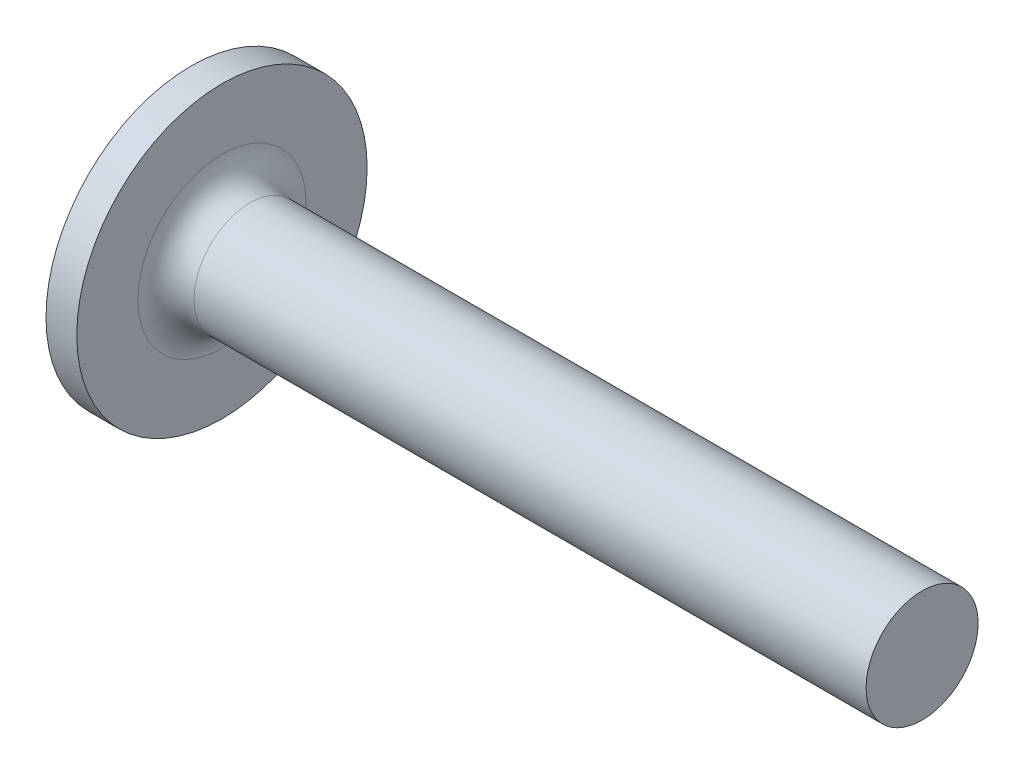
ISO-10303-21;
HEADER;
FILE_DESCRIPTION(('STEP AP214'),'2;1');
FILE_NAME('part.step','',(''),(''),'','','');
FILE_SCHEMA(('AUTOMOTIVE_DESIGN { 1 0 10303 214 1 1 1 1 }'));
ENDSEC;
DATA;
#1=APPLICATION_CONTEXT('core data for automotive mechanical design processes');
#2=APPLICATION_PROTOCOL_DEFINITION('international standard','automotive_design',2000,#1);
#3=PRODUCT_CONTEXT('',#1,'mechanical');
#4=PRODUCT('Part','Part','',(#3));
#5=PRODUCT_RELATED_PRODUCT_CATEGORY('part','',(#4));
#6=PRODUCT_DEFINITION_FORMATION('','',#4);
#7=PRODUCT_DEFINITION_CONTEXT('part definition',#1,'design');
#8=PRODUCT_DEFINITION('design','',#6,#7);
#9=PRODUCT_DEFINITION_SHAPE('','',#8);
#10=(LENGTH_UNIT() NAMED_UNIT(*) SI_UNIT(.MILLI.,.METRE.));
#11=(NAMED_UNIT(*) PLANE_ANGLE_UNIT() SI_UNIT($,.RADIAN.));
#12=(NAMED_UNIT(*) SI_UNIT($,.STERADIAN.) SOLID_ANGLE_UNIT());
#13=UNCERTAINTY_MEASURE_WITH_UNIT(LENGTH_MEASURE(1.E-05),#10,'distance_accuracy_value','');
#14=(GEOMETRIC_REPRESENTATION_CONTEXT(3) GLOBAL_UNCERTAINTY_ASSIGNED_CONTEXT((#13)) GLOBAL_UNIT_ASSIGNED_CONTEXT((#10,
#11,#12)) REPRESENTATION_CONTEXT('',''));
#15=CARTESIAN_POINT('',(0.,0.,0.));
#16=DIRECTION('',(0.,0.,1.));
#17=DIRECTION('',(1.,0.,0.));
#18=AXIS2_PLACEMENT_3D('',#15,#16,#17);
#19=CARTESIAN_POINT('',(4.6,-2.10652468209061,1.08));
#20=DIRECTION('',(0.,0.,1.));
#21=DIRECTION('',(1.,0.,0.));
#22=AXIS2_PLACEMENT_3D('',#19,#20,#21);
#23=PLANE('',#22);
#24=CARTESIAN_POINT('',(-3.41826491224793,-2.24491338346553,1.08));
#25=CARTESIAN_POINT('',(-2.73358329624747,-2.19177170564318,1.08));
#26=CARTESIAN_POINT('',(-2.04892704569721,-2.13829978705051,1.08));
#27=CARTESIAN_POINT('',(-0.679674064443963,-2.03046942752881,1.08));
#28=CARTESIAN_POINT('',(0.00492266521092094,-1.97611097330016,1.08));
#29=CARTESIAN_POINT('',(1.37402690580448,-1.86628311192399,1.08));
#30=CARTESIAN_POINT('',(2.05853441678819,-1.81081370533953,1.08));
#31=CARTESIAN_POINT('',(3.08520090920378,-1.72651192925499,1.08));
#32=CARTESIAN_POINT('',(3.4274049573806,-1.69822858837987,1.08));
#33=CARTESIAN_POINT('',(4.11177903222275,-1.64123354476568,1.08));
#34=CARTESIAN_POINT('',(4.45394905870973,-1.6125218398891,1.08));
#35=CARTESIAN_POINT('',(5.52850433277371,-1.52157600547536,1.08));
#36=CARTESIAN_POINT('',(6.26081563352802,-1.45845930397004,1.08));
#37=CARTESIAN_POINT('',(7.35905590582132,-1.36129752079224,1.08));
#38=CARTESIAN_POINT('',(7.7250949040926,-1.32849611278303,1.08));
#39=CARTESIAN_POINT('',(8.45707977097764,-1.26185170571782,1.08));
#40=CARTESIAN_POINT('',(8.82302563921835,-1.22800870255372,1.08));
#41=CARTESIAN_POINT('',(9.55482746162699,-1.15899574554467,1.08));
#42=CARTESIAN_POINT('',(9.92068340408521,-1.12382566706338,1.08));
#43=CARTESIAN_POINT('',(10.6522200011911,-1.05174208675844,1.08));
#44=CARTESIAN_POINT('',(11.0179006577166,-1.01482860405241,1.08));
#45=CARTESIAN_POINT('',(11.7490413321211,-0.938612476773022,1.08));
#46=CARTESIAN_POINT('',(12.1145013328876,-0.899309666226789,1.08));
#47=CARTESIAN_POINT('',(12.662403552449,-0.837726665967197,1.08));
#48=CARTESIAN_POINT('',(12.8449930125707,-0.816760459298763,1.08));
#49=CARTESIAN_POINT('',(13.2100411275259,-0.773701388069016,1.08));
#50=CARTESIAN_POINT('',(13.3924997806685,-0.751608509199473,1.08));
#51=CARTESIAN_POINT('',(13.5748743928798,-0.72882726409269,1.08));
#52=B_SPLINE_CURVE_WITH_KNOTS('',3,(#24,#25,#26,#27,#28,#29,#30,#31,#32,#33,#34,#35,#36,#37,#38,
#39,#40,#41,#42,#43,#44,#45,#46,#47,#48,#49,#50,#51),.UNSPECIFIED.,.F.,.F.,(4,2,2,2,2,2,2,2,2,2,
2,2,2,4),(0.,2.06022276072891,4.12047645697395,6.18072910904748,7.21084146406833,
8.24095896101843,10.4460312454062,11.5485474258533,12.6510679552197,13.753692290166,
14.8563045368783,15.9589934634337,16.5103581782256,17.0617298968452),.UNSPECIFIED.);
#53=CARTESIAN_POINT('',(4.6,-1.60013444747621,1.08));
#54=VERTEX_POINT('',#53);
#55=CARTESIAN_POINT('',(0.229677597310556,-1.95799778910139,1.08));
#56=VERTEX_POINT('',#55);
#57=EDGE_CURVE('E329',#54,#56,#52,.F.);
#58=ORIENTED_EDGE('',*,*,#57,.F.);
#59=DIRECTION('',(0.,1.,0.));
#60=VECTOR('',#59,1.);
#61=CARTESIAN_POINT('',(4.6,-2.10652468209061,1.08));
#62=LINE('',#61,#60);
#63=CARTESIAN_POINT('',(4.6,-2.10652468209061,1.08));
#64=VERTEX_POINT('',#63);
#65=EDGE_CURVE('E288',#64,#54,#62,.T.);
#66=ORIENTED_EDGE('',*,*,#65,.F.);
#67=DIRECTION('',(0.894934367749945,0.446197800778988,0.));
#68=VECTOR('',#67,1.);
#69=CARTESIAN_POINT('',(0.,-4.4,1.08));
#70=LINE('',#69,#68);
#71=CARTESIAN_POINT('',(0.808838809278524,-3.9967278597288,1.08));
#72=VERTEX_POINT('',#71);
#73=EDGE_CURVE('E274',#72,#64,#70,.T.);
#74=ORIENTED_EDGE('',*,*,#73,.F.);
#75=CARTESIAN_POINT('',(11.,0.,1.08));
#76=DIRECTION('',(0.,0.,1.));
#77=DIRECTION('',(1.,0.,0.));
#78=AXIS2_PLACEMENT_3D('',#75,#76,#77);
#79=CIRCLE('',#78,10.9468534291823);
#80=EDGE_CURVE('E212',#56,#72,#79,.T.);
#81=ORIENTED_EDGE('',*,*,#80,.F.);
#82=EDGE_LOOP('',(#58,#66,#74,#81));
#83=FACE_BOUND('',#82,.T.);
#84=ADVANCED_FACE('F39',(#83),#23,.F.);
#85=CARTESIAN_POINT('',(4.6,2.106524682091,-1.08));
#86=DIRECTION('',(0.,0.,-1.));
#87=DIRECTION('',(0.,1.,0.));
#88=AXIS2_PLACEMENT_3D('',#85,#86,#87);
#89=PLANE('',#88);
#90=CARTESIAN_POINT('',(-3.4182649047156,-2.24491338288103,-1.08));
#91=CARTESIAN_POINT('',(-2.73358328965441,-2.19177170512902,-1.08));
#92=CARTESIAN_POINT('',(-2.04892704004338,-2.13829978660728,-1.08));
#93=CARTESIAN_POINT('',(-0.679674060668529,-2.03046942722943,-1.08));
#94=CARTESIAN_POINT('',(0.00492266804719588,-1.97611097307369,-1.08));
#95=CARTESIAN_POINT('',(1.37402690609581,-1.86628311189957,-1.08));
#96=CARTESIAN_POINT('',(2.05853441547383,-1.81081370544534,-1.08));
#97=CARTESIAN_POINT('',(3.08520090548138,-1.7265119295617,-1.08));
#98=CARTESIAN_POINT('',(3.42740495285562,-1.69822858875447,-1.08));
#99=CARTESIAN_POINT('',(4.1117790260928,-1.64123354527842,-1.08));
#100=CARTESIAN_POINT('',(4.45394905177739,-1.61252184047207,-1.08));
#101=CARTESIAN_POINT('',(5.52850432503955,-1.52157600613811,-1.08));
#102=CARTESIAN_POINT('',(6.26081562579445,-1.45845930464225,-1.08));
#103=CARTESIAN_POINT('',(7.35905589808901,-1.36129752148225,-1.08));
#104=CARTESIAN_POINT('',(7.7250948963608,-1.32849611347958,-1.08));
#105=CARTESIAN_POINT('',(8.45707976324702,-1.26185170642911,-1.08));
#106=CARTESIAN_POINT('',(8.8230256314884,-1.22800870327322,-1.08));
#107=CARTESIAN_POINT('',(9.55482745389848,-1.15899574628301,-1.08));
#108=CARTESIAN_POINT('',(9.92068339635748,-1.12382566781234,-1.08));
#109=CARTESIAN_POINT('',(10.6522199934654,-1.05174208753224,-1.08));
#110=CARTESIAN_POINT('',(11.017900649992,-1.01482860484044,-1.08));
#111=CARTESIAN_POINT('',(11.7490413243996,-0.938612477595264,-1.08));
#112=CARTESIAN_POINT('',(12.1145013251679,-0.899309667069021,-1.08));
#113=CARTESIAN_POINT('',(12.6624035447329,-0.837726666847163,-1.08));
#114=CARTESIAN_POINT('',(12.8449930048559,-0.816760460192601,-1.08));
#115=CARTESIAN_POINT('',(13.2100411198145,-0.773701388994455,-1.08));
#116=CARTESIAN_POINT('',(13.392499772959,-0.751608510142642,-1.08));
#117=CARTESIAN_POINT('',(13.5748743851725,-0.728827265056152,-1.08));
#118=B_SPLINE_CURVE_WITH_KNOTS('',3,(#90,#91,#92,#93,#94,#95,#96,#97,#98,#99,#100,#101,#102,
#103,#104,#105,#106,#107,#108,#109,#110,#111,#112,#113,#114,#115,#116,#117),.UNSPECIFIED.,.F.,
.F.,(4,2,2,2,2,2,2,2,2,2,2,2,2,4),(0.,2.0602227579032,4.12047645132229,6.18072909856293,
7.21084145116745,8.24095894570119,10.4460312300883,11.5485474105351,12.6510679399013,
13.7536922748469,14.8563045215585,15.9589934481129,16.5103581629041,17.061729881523),.UNSPECIFIED.);
#119=CARTESIAN_POINT('',(0.229677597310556,-1.95799778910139,-1.08));
#120=VERTEX_POINT('',#119);
#121=CARTESIAN_POINT('',(4.6,-1.60013444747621,-1.08));
#122=VERTEX_POINT('',#121);
#123=EDGE_CURVE('E321',#120,#122,#118,.T.);
#124=ORIENTED_EDGE('',*,*,#123,.F.);
#125=CARTESIAN_POINT('',(11.,0.,-1.08));
#126=DIRECTION('',(0.,0.,-1.));
#127=DIRECTION('',(0.,1.,0.));
#128=AXIS2_PLACEMENT_3D('',#125,#126,#127);
#129=CIRCLE('',#128,10.9468534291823);
#130=CARTESIAN_POINT('',(0.808838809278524,-3.9967278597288,-1.08));
#131=VERTEX_POINT('',#130);
#132=EDGE_CURVE('E217',#131,#120,#129,.T.);
#133=ORIENTED_EDGE('',*,*,#132,.F.);
#134=DIRECTION('',(0.894934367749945,0.446197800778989,0.));
#135=VECTOR('',#134,1.);
#136=CARTESIAN_POINT('',(0.,-4.4,-1.08));
#137=LINE('',#136,#135);
#138=CARTESIAN_POINT('',(4.6,-2.10652468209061,-1.08));
#139=VERTEX_POINT('',#138);
#140=EDGE_CURVE('E277',#131,#139,#137,.T.);
#141=ORIENTED_EDGE('',*,*,#140,.T.);
#142=DIRECTION('',(0.,-1.,0.));
#143=VECTOR('',#142,1.);
#144=CARTESIAN_POINT('',(4.6,2.106524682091,-1.08));
#145=LINE('',#144,#143);
#146=EDGE_CURVE('E287',#122,#139,#145,.T.);
#147=ORIENTED_EDGE('',*,*,#146,.F.);
#148=EDGE_LOOP('',(#124,#133,#141,#147));
#149=FACE_BOUND('',#148,.T.);
#150=ADVANCED_FACE('F171',(#149),#89,.F.);
#151=CARTESIAN_POINT('',(11.,0.,0.));
#152=DIRECTION('',(-1.,0.,0.));
#153=DIRECTION('',(0.,1.,0.));
#154=AXIS2_PLACEMENT_3D('',#151,#152,#153);
#155=SPHERICAL_SURFACE('',#154,11.);
#156=CARTESIAN_POINT('',(3.7,0.,0.));
#157=DIRECTION('',(1.,0.,0.));
#158=DIRECTION('',(0.,0.,-1.));
#159=AXIS2_PLACEMENT_3D('',#156,#157,#158);
#160=CIRCLE('',#159,8.22860863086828);
#161=CARTESIAN_POINT('',(3.7,0.,-8.22860863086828));
#162=VERTEX_POINT('',#161);
#163=EDGE_CURVE('E310',#162,#162,#160,.F.);
#164=ORIENTED_EDGE('',*,*,#163,.T.);
#165=EDGE_LOOP('',(#164));
#166=FACE_BOUND('',#165,.T.);
#167=CARTESIAN_POINT('',(0.229677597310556,0.,0.));
#168=DIRECTION('',(1.,0.,0.));
#169=DIRECTION('',(0.,0.,-1.));
#170=AXIS2_PLACEMENT_3D('',#167,#168,#169);
#171=CIRCLE('',#170,2.23610271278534);
#172=CARTESIAN_POINT('',(0.229677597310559,-1.07999999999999,-1.9579977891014));
#173=VERTEX_POINT('',#172);
#174=EDGE_CURVE('E315',#173,#120,#171,.F.);
#175=ORIENTED_EDGE('',*,*,#174,.F.);
#176=CARTESIAN_POINT('',(11.,-1.08,0.));
#177=DIRECTION('',(0.,-1.,0.));
#178=DIRECTION('',(0.,0.,-1.));
#179=AXIS2_PLACEMENT_3D('',#176,#177,#178);
#180=CIRCLE('',#179,10.9468534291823);
#181=CARTESIAN_POINT('',(0.808838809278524,-1.07999999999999,-3.99672785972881));
#182=VERTEX_POINT('',#181);
#183=EDGE_CURVE('E228',#173,#182,#180,.T.);
#184=ORIENTED_EDGE('',*,*,#183,.T.);
#185=CARTESIAN_POINT('',(10.5669808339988,0.,0.868502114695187));
#186=DIRECTION('',(0.446197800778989,0.,-0.894934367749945));
#187=DIRECTION('',(-0.894934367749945,0.,-0.446197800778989));
#188=AXIS2_PLACEMENT_3D('',#185,#186,#187);
#189=CIRCLE('',#188,10.957107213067);
#190=CARTESIAN_POINT('',(0.808838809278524,1.08000000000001,-3.9967278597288));
#191=VERTEX_POINT('',#190);
#192=EDGE_CURVE('E53',#182,#191,#189,.T.);
#193=ORIENTED_EDGE('',*,*,#192,.T.);
#194=CARTESIAN_POINT('',(11.,1.08,0.));
#195=DIRECTION('',(0.,1.,0.));
#196=DIRECTION('',(0.,0.,1.));
#197=AXIS2_PLACEMENT_3D('',#194,#195,#196);
#198=CIRCLE('',#197,10.9468534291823);
#199=CARTESIAN_POINT('',(0.229677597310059,1.08000000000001,-1.95799778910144));
#200=VERTEX_POINT('',#199);
#201=EDGE_CURVE('E226',#191,#200,#198,.T.);
#202=ORIENTED_EDGE('',*,*,#201,.T.);
#203=CARTESIAN_POINT('',(0.229677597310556,1.95799778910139,-1.08));
#204=VERTEX_POINT('',#203);
#205=EDGE_CURVE('E378',#204,#200,#171,.F.);
#206=ORIENTED_EDGE('',*,*,#205,.F.);
#207=CARTESIAN_POINT('',(0.808838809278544,3.99672785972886,-1.08));
#208=VERTEX_POINT('',#207);
#209=EDGE_CURVE('E312',#204,#208,#129,.T.);
#210=ORIENTED_EDGE('',*,*,#209,.T.);
#211=CARTESIAN_POINT('',(10.5669808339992,-0.868502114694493,0.));
#212=DIRECTION('',(0.446197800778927,0.894934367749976,0.));
#213=DIRECTION('',(-0.894934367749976,0.446197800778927,0.));
#214=AXIS2_PLACEMENT_3D('',#211,#212,#213);
#215=CIRCLE('',#214,10.9571072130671);
#216=CARTESIAN_POINT('',(0.808838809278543,3.99672785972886,1.08));
#217=VERTEX_POINT('',#216);
#218=EDGE_CURVE('E210',#208,#217,#215,.T.);
#219=ORIENTED_EDGE('',*,*,#218,.T.);
#220=CARTESIAN_POINT('',(0.229677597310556,1.95799778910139,1.08));
#221=VERTEX_POINT('',#220);
#222=EDGE_CURVE('E200',#217,#221,#79,.T.);
#223=ORIENTED_EDGE('',*,*,#222,.T.);
#224=CARTESIAN_POINT('',(0.229677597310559,1.07999999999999,1.9579977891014));
#225=VERTEX_POINT('',#224);
#226=EDGE_CURVE('E204',#225,#221,#171,.F.);
#227=ORIENTED_EDGE('',*,*,#226,.F.);
#228=CARTESIAN_POINT('',(0.808838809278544,1.07999999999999,3.99672785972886));
#229=VERTEX_POINT('',#228);
#230=EDGE_CURVE('E245',#225,#229,#198,.T.);
#231=ORIENTED_EDGE('',*,*,#230,.T.);
#232=CARTESIAN_POINT('',(10.5669808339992,0.,-0.868502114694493));
#233=DIRECTION('',(0.446197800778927,0.,0.894934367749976));
#234=DIRECTION('',(0.894934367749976,0.,-0.446197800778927));
#235=AXIS2_PLACEMENT_3D('',#232,#233,#234);
#236=CIRCLE('',#235,10.9571072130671);
#237=CARTESIAN_POINT('',(0.808838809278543,-1.08000000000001,3.99672785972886));
#238=VERTEX_POINT('',#237);
#239=EDGE_CURVE('E215',#229,#238,#236,.T.);
#240=ORIENTED_EDGE('',*,*,#239,.T.);
#241=CARTESIAN_POINT('',(0.22967759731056,-1.08000000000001,1.9579977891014));
#242=VERTEX_POINT('',#241);
#243=EDGE_CURVE('E273',#238,#242,#180,.T.);
#244=ORIENTED_EDGE('',*,*,#243,.T.);
#245=EDGE_CURVE('E333',#56,#242,#171,.F.);
#246=ORIENTED_EDGE('',*,*,#245,.F.);
#247=ORIENTED_EDGE('',*,*,#80,.T.);
#248=CARTESIAN_POINT('',(10.5669808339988,0.868502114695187,0.));
#249=DIRECTION('',(0.446197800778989,-0.894934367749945,0.));
#250=DIRECTION('',(0.894934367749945,0.446197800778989,0.));
#251=AXIS2_PLACEMENT_3D('',#248,#249,#250);
#252=CIRCLE('',#251,10.957107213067);
#253=EDGE_CURVE('E211',#72,#131,#252,.T.);
#254=ORIENTED_EDGE('',*,*,#253,.T.);
#255=ORIENTED_EDGE('',*,*,#132,.T.);
#256=EDGE_LOOP('',(#175,#184,#193,#202,#206,#210,#219,#223,#227,#231,#240,#244,#246,#247,#254,#255));
#257=FACE_BOUND('',#256,.T.);
#258=ADVANCED_FACE('F179',(#166,#257),#155,.T.);
#259=CARTESIAN_POINT('',(-3.41826491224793,2.24491338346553,1.08));
#260=CARTESIAN_POINT('',(-2.73358329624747,2.19177170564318,1.08));
#261=CARTESIAN_POINT('',(-2.04892704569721,2.13829978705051,1.08));
#262=CARTESIAN_POINT('',(-0.679674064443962,2.03046942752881,1.08));
#263=CARTESIAN_POINT('',(0.00492266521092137,1.97611097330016,1.08));
#264=CARTESIAN_POINT('',(1.37402690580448,1.86628311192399,1.08));
#265=CARTESIAN_POINT('',(2.05853441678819,1.81081370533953,1.08));
#266=CARTESIAN_POINT('',(3.08520090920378,1.72651192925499,1.08));
#267=CARTESIAN_POINT('',(3.4274049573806,1.69822858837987,1.08));
#268=CARTESIAN_POINT('',(4.11177903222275,1.64123354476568,1.08));
#269=CARTESIAN_POINT('',(4.45394905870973,1.6125218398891,1.08));
#270=CARTESIAN_POINT('',(5.52850433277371,1.52157600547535,1.08));
#271=CARTESIAN_POINT('',(6.26081563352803,1.45845930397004,1.08));
#272=CARTESIAN_POINT('',(7.35905590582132,1.36129752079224,1.08));
#273=CARTESIAN_POINT('',(7.72509490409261,1.32849611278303,1.08));
#274=CARTESIAN_POINT('',(8.45707977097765,1.26185170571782,1.08));
#275=CARTESIAN_POINT('',(8.82302563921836,1.22800870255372,1.08));
#276=CARTESIAN_POINT('',(9.554827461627,1.15899574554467,1.08));
#277=CARTESIAN_POINT('',(9.92068340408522,1.12382566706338,1.08));
#278=CARTESIAN_POINT('',(10.6522200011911,1.05174208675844,1.08));
#279=CARTESIAN_POINT('',(11.0179006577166,1.01482860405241,1.08));
#280=CARTESIAN_POINT('',(11.7490413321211,0.938612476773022,1.08));
#281=CARTESIAN_POINT('',(12.1145013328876,0.899309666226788,1.08));
#282=CARTESIAN_POINT('',(12.662403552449,0.837726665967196,1.08));
#283=CARTESIAN_POINT('',(12.8449930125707,0.816760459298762,1.08));
#284=CARTESIAN_POINT('',(13.2100411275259,0.773701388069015,1.08));
#285=CARTESIAN_POINT('',(13.3924997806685,0.751608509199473,1.08));
#286=CARTESIAN_POINT('',(13.5748743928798,0.728827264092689,1.08));
#287=B_SPLINE_CURVE_WITH_KNOTS('',3,(#259,#260,#261,#262,#263,#264,#265,#266,#267,#268,#269,
#270,#271,#272,#273,#274,#275,#276,#277,#278,#279,#280,#281,#282,#283,#284,#285,#286),
.UNSPECIFIED.,.F.,.F.,(4,2,2,2,2,2,2,2,2,2,2,2,2,4),(0.,2.06022276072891,4.12047645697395,
6.18072910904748,7.21084146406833,8.24095896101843,10.4460312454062,11.5485474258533,
12.6510679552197,13.753692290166,14.8563045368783,15.9589934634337,16.5103581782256,
17.0617298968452),.UNSPECIFIED.);
#288=CARTESIAN_POINT('',(4.6,1.60013444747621,1.08));
#289=VERTEX_POINT('',#288);
#290=EDGE_CURVE('E198',#221,#289,#287,.T.);
#291=ORIENTED_EDGE('',*,*,#290,.F.);
#292=ORIENTED_EDGE('',*,*,#222,.F.);
#293=DIRECTION('',(0.894934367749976,-0.446197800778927,0.));
#294=VECTOR('',#293,1.);
#295=CARTESIAN_POINT('',(0.,4.4,1.08));
#296=LINE('',#295,#294);
#297=CARTESIAN_POINT('',(4.6,2.106524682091,1.08));
#298=VERTEX_POINT('',#297);
#299=EDGE_CURVE('E67',#217,#298,#296,.T.);
#300=ORIENTED_EDGE('',*,*,#299,.T.);
#301=EDGE_CURVE('E202',#289,#298,#62,.T.);
#302=ORIENTED_EDGE('',*,*,#301,.F.);
#303=EDGE_LOOP('',(#291,#292,#300,#302));
#304=FACE_BOUND('',#303,.T.);
#305=ADVANCED_FACE('F174',(#304),#23,.F.);
#306=CARTESIAN_POINT('',(-3.4182649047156,2.24491338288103,-1.08));
#307=CARTESIAN_POINT('',(-2.73358328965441,2.19177170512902,-1.08));
#308=CARTESIAN_POINT('',(-2.04892704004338,2.13829978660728,-1.08));
#309=CARTESIAN_POINT('',(-0.679674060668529,2.03046942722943,-1.08));
#310=CARTESIAN_POINT('',(0.00492266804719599,1.97611097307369,-1.08));
#311=CARTESIAN_POINT('',(1.37402690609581,1.86628311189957,-1.08));
#312=CARTESIAN_POINT('',(2.05853441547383,1.81081370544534,-1.08));
#313=CARTESIAN_POINT('',(3.08520090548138,1.7265119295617,-1.08));
#314=CARTESIAN_POINT('',(3.42740495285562,1.69822858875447,-1.08));
#315=CARTESIAN_POINT('',(4.1117790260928,1.64123354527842,-1.08));
#316=CARTESIAN_POINT('',(4.45394905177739,1.61252184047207,-1.08));
#317=CARTESIAN_POINT('',(5.52850432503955,1.52157600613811,-1.08));
#318=CARTESIAN_POINT('',(6.26081562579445,1.45845930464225,-1.08));
#319=CARTESIAN_POINT('',(7.35905589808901,1.36129752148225,-1.08));
#320=CARTESIAN_POINT('',(7.7250948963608,1.32849611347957,-1.08));
#321=CARTESIAN_POINT('',(8.45707976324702,1.26185170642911,-1.08));
#322=CARTESIAN_POINT('',(8.8230256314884,1.22800870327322,-1.08));
#323=CARTESIAN_POINT('',(9.55482745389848,1.15899574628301,-1.08));
#324=CARTESIAN_POINT('',(9.92068339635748,1.12382566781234,-1.08));
#325=CARTESIAN_POINT('',(10.6522199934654,1.05174208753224,-1.08));
#326=CARTESIAN_POINT('',(11.017900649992,1.01482860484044,-1.08));
#327=CARTESIAN_POINT('',(11.7490413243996,0.938612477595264,-1.08));
#328=CARTESIAN_POINT('',(12.1145013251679,0.899309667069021,-1.08));
#329=CARTESIAN_POINT('',(12.6624035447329,0.837726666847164,-1.08));
#330=CARTESIAN_POINT('',(12.8449930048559,0.816760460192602,-1.08));
#331=CARTESIAN_POINT('',(13.2100411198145,0.773701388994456,-1.08));
#332=CARTESIAN_POINT('',(13.392499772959,0.751608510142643,-1.08));
#333=CARTESIAN_POINT('',(13.5748743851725,0.728827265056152,-1.08));
#334=B_SPLINE_CURVE_WITH_KNOTS('',3,(#306,#307,#308,#309,#310,#311,#312,#313,#314,#315,#316,
#317,#318,#319,#320,#321,#322,#323,#324,#325,#326,#327,#328,#329,#330,#331,#332,#333),
.UNSPECIFIED.,.F.,.F.,(4,2,2,2,2,2,2,2,2,2,2,2,2,4),(0.,2.0602227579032,4.12047645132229,
6.18072909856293,7.21084145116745,8.24095894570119,10.4460312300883,11.5485474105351,
12.6510679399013,13.7536922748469,14.8563045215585,15.9589934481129,16.5103581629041,
17.061729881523),.UNSPECIFIED.);
#335=CARTESIAN_POINT('',(4.6,1.60013444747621,-1.08));
#336=VERTEX_POINT('',#335);
#337=EDGE_CURVE('E250',#336,#204,#334,.F.);
#338=ORIENTED_EDGE('',*,*,#337,.F.);
#339=CARTESIAN_POINT('',(4.6,2.106524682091,-1.08));
#340=VERTEX_POINT('',#339);
#341=EDGE_CURVE('E289',#340,#336,#145,.T.);
#342=ORIENTED_EDGE('',*,*,#341,.F.);
#343=DIRECTION('',(0.894934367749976,-0.446197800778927,0.));
#344=VECTOR('',#343,1.);
#345=CARTESIAN_POINT('',(0.,4.4,-1.08));
#346=LINE('',#345,#344);
#347=EDGE_CURVE('E281',#208,#340,#346,.T.);
#348=ORIENTED_EDGE('',*,*,#347,.F.);
#349=ORIENTED_EDGE('',*,*,#209,.F.);
#350=EDGE_LOOP('',(#338,#342,#348,#349));
#351=FACE_BOUND('',#350,.T.);
#352=ADVANCED_FACE('F182',(#351),#89,.F.);
#353=CARTESIAN_POINT('',(4.6,2.106524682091,1.08));
#354=DIRECTION('',(-1.,0.,0.));
#355=DIRECTION('',(0.,0.,1.));
#356=AXIS2_PLACEMENT_3D('',#353,#354,#355);
#357=PLANE('',#356);
#358=ORIENTED_EDGE('',*,*,#65,.T.);
#359=CARTESIAN_POINT('',(4.6,0.,0.));
#360=DIRECTION('',(-1.,0.,0.));
#361=DIRECTION('',(0.,0.,1.));
#362=AXIS2_PLACEMENT_3D('',#359,#360,#361);
#363=CIRCLE('',#362,1.9305);
#364=EDGE_CURVE('E464',#122,#54,#363,.T.);
#365=ORIENTED_EDGE('',*,*,#364,.F.);
#366=ORIENTED_EDGE('',*,*,#146,.T.);
#367=DIRECTION('',(0.,0.,1.));
#368=VECTOR('',#367,1.);
#369=CARTESIAN_POINT('',(4.6,-2.10652468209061,-1.08));
#370=LINE('',#369,#368);
#371=EDGE_CURVE('E283',#139,#64,#370,.T.);
#372=ORIENTED_EDGE('',*,*,#371,.T.);
#373=EDGE_LOOP('',(#358,#365,#366,#372));
#374=FACE_BOUND('',#373,.T.);
#375=ADVANCED_FACE('F192',(#374),#357,.T.);
#376=DIRECTION('',(0.,0.,1.));
#377=VECTOR('',#376,1.);
#378=CARTESIAN_POINT('',(4.6,-1.07999999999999,-2.10652468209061));
#379=LINE('',#378,#377);
#380=CARTESIAN_POINT('',(4.6,-1.07999999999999,-2.10652468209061));
#381=VERTEX_POINT('',#380);
#382=CARTESIAN_POINT('',(4.6,-1.07999999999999,-1.60013444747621));
#383=VERTEX_POINT('',#382);
#384=EDGE_CURVE('E243',#381,#383,#379,.T.);
#385=ORIENTED_EDGE('',*,*,#384,.T.);
#386=CARTESIAN_POINT('',(4.6,1.08000000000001,-1.60013444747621));
#387=VERTEX_POINT('',#386);
#388=EDGE_CURVE('E468',#387,#383,#363,.T.);
#389=ORIENTED_EDGE('',*,*,#388,.F.);
#390=DIRECTION('',(0.,0.,-1.));
#391=VECTOR('',#390,1.);
#392=CARTESIAN_POINT('',(4.6,1.07999999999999,2.106524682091));
#393=LINE('',#392,#391);
#394=CARTESIAN_POINT('',(4.6,1.08000000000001,-2.1065246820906));
#395=VERTEX_POINT('',#394);
#396=EDGE_CURVE('E265',#387,#395,#393,.T.);
#397=ORIENTED_EDGE('',*,*,#396,.T.);
#398=DIRECTION('',(0.,-1.,0.));
#399=VECTOR('',#398,1.);
#400=CARTESIAN_POINT('',(4.6,1.08000000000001,-2.1065246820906));
#401=LINE('',#400,#399);
#402=EDGE_CURVE('E261',#395,#381,#401,.T.);
#403=ORIENTED_EDGE('',*,*,#402,.T.);
#404=EDGE_LOOP('',(#385,#389,#397,#403));
#405=FACE_BOUND('',#404,.T.);
#406=ADVANCED_FACE('F474',(#405),#357,.T.);
#407=ORIENTED_EDGE('',*,*,#341,.T.);
#408=EDGE_CURVE('E455',#289,#336,#363,.T.);
#409=ORIENTED_EDGE('',*,*,#408,.F.);
#410=ORIENTED_EDGE('',*,*,#301,.T.);
#411=DIRECTION('',(0.,0.,-1.));
#412=VECTOR('',#411,1.);
#413=CARTESIAN_POINT('',(4.6,2.106524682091,1.08));
#414=LINE('',#413,#412);
#415=EDGE_CURVE('E284',#298,#340,#414,.T.);
#416=ORIENTED_EDGE('',*,*,#415,.T.);
#417=EDGE_LOOP('',(#407,#409,#410,#416));
#418=FACE_BOUND('',#417,.T.);
#419=ADVANCED_FACE('F383',(#418),#357,.T.);
#420=CARTESIAN_POINT('',(4.6,1.07999999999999,2.106524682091));
#421=DIRECTION('',(0.,1.,0.));
#422=DIRECTION('',(0.,0.,1.));
#423=AXIS2_PLACEMENT_3D('',#420,#421,#422);
#424=PLANE('',#423);
#425=CARTESIAN_POINT('',(-3.4182649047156,1.08000000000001,-2.24491338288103));
#426=CARTESIAN_POINT('',(-2.73358328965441,1.08000000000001,-2.19177170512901));
#427=CARTESIAN_POINT('',(-2.04892704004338,1.08000000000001,-2.13829978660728));
#428=CARTESIAN_POINT('',(-0.67967406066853,1.08000000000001,-2.03046942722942));
#429=CARTESIAN_POINT('',(0.00492266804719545,1.08000000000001,-1.97611097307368));
#430=CARTESIAN_POINT('',(1.37402690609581,1.08000000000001,-1.86628311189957));
#431=CARTESIAN_POINT('',(2.05853441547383,1.08000000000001,-1.81081370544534));
#432=CARTESIAN_POINT('',(3.08520090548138,1.08000000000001,-1.72651192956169));
#433=CARTESIAN_POINT('',(3.42740495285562,1.08000000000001,-1.69822858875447));
#434=CARTESIAN_POINT('',(4.1117790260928,1.08000000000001,-1.64123354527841));
#435=CARTESIAN_POINT('',(4.45394905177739,1.08000000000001,-1.61252184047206));
#436=CARTESIAN_POINT('',(5.52850432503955,1.08000000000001,-1.5215760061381));
#437=CARTESIAN_POINT('',(6.26081562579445,1.08000000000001,-1.45845930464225));
#438=CARTESIAN_POINT('',(7.35905589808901,1.08000000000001,-1.36129752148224));
#439=CARTESIAN_POINT('',(7.7250948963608,1.08000000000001,-1.32849611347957));
#440=CARTESIAN_POINT('',(8.45707976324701,1.08000000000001,-1.2618517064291));
#441=CARTESIAN_POINT('',(8.8230256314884,1.08000000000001,-1.22800870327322));
#442=CARTESIAN_POINT('',(9.55482745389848,1.08,-1.158995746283));
#443=CARTESIAN_POINT('',(9.92068339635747,1.08,-1.12382566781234));
#444=CARTESIAN_POINT('',(10.6522199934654,1.08,-1.05174208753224));
#445=CARTESIAN_POINT('',(11.017900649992,1.08,-1.01482860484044));
#446=CARTESIAN_POINT('',(11.7490413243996,1.08,-0.938612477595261));
#447=CARTESIAN_POINT('',(12.1145013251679,1.08,-0.899309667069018));
#448=CARTESIAN_POINT('',(12.6624035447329,1.08,-0.83772666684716));
#449=CARTESIAN_POINT('',(12.8449930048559,1.08,-0.816760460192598));
#450=CARTESIAN_POINT('',(13.2100411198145,1.08,-0.773701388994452));
#451=CARTESIAN_POINT('',(13.392499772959,1.08,-0.751608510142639));
#452=CARTESIAN_POINT('',(13.5748743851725,1.08,-0.728827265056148));
#453=B_SPLINE_CURVE_WITH_KNOTS('',3,(#425,#426,#427,#428,#429,#430,#431,#432,#433,#434,#435,
#436,#437,#438,#439,#440,#441,#442,#443,#444,#445,#446,#447,#448,#449,#450,#451,#452),
.UNSPECIFIED.,.F.,.F.,(4,2,2,2,2,2,2,2,2,2,2,2,2,4),(0.,2.0602227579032,4.12047645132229,
6.18072909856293,7.21084145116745,8.24095894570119,10.4460312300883,11.5485474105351,
12.6510679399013,13.7536922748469,14.8563045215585,15.9589934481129,16.5103581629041,
17.061729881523),.UNSPECIFIED.);
#454=EDGE_CURVE('E373',#200,#387,#453,.T.);
#455=ORIENTED_EDGE('',*,*,#454,.F.);
#456=ORIENTED_EDGE('',*,*,#201,.F.);
#457=DIRECTION('',(0.894934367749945,0.,0.446197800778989));
#458=VECTOR('',#457,1.);
#459=CARTESIAN_POINT('',(0.,1.08000000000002,-4.4));
#460=LINE('',#459,#458);
#461=EDGE_CURVE('E237',#191,#395,#460,.T.);
#462=ORIENTED_EDGE('',*,*,#461,.T.);
#463=ORIENTED_EDGE('',*,*,#396,.F.);
#464=EDGE_LOOP('',(#455,#456,#462,#463));
#465=FACE_BOUND('',#464,.T.);
#466=ADVANCED_FACE('F379',(#465),#424,.F.);
#467=CARTESIAN_POINT('',(4.6,-1.07999999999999,-2.10652468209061));
#468=DIRECTION('',(0.,-1.,0.));
#469=DIRECTION('',(1.,0.,0.));
#470=AXIS2_PLACEMENT_3D('',#467,#468,#469);
#471=PLANE('',#470);
#472=CARTESIAN_POINT('',(-3.41826491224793,-1.07999999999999,-2.24491338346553));
#473=CARTESIAN_POINT('',(-2.73358329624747,-1.07999999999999,-2.19177170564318));
#474=CARTESIAN_POINT('',(-2.04892704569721,-1.07999999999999,-2.13829978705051));
#475=CARTESIAN_POINT('',(-0.679674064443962,-1.07999999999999,-2.03046942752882));
#476=CARTESIAN_POINT('',(0.0049226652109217,-1.07999999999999,-1.97611097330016));
#477=CARTESIAN_POINT('',(1.37402690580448,-1.07999999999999,-1.86628311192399));
#478=CARTESIAN_POINT('',(2.05853441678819,-1.07999999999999,-1.81081370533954));
#479=CARTESIAN_POINT('',(3.08520090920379,-1.07999999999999,-1.72651192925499));
#480=CARTESIAN_POINT('',(3.4274049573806,-1.07999999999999,-1.69822858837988));
#481=CARTESIAN_POINT('',(4.11177903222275,-1.07999999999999,-1.64123354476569));
#482=CARTESIAN_POINT('',(4.45394905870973,-1.07999999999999,-1.6125218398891));
#483=CARTESIAN_POINT('',(5.52850433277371,-1.07999999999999,-1.52157600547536));
#484=CARTESIAN_POINT('',(6.26081563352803,-1.08,-1.45845930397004));
#485=CARTESIAN_POINT('',(7.35905590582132,-1.08,-1.36129752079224));
#486=CARTESIAN_POINT('',(7.72509490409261,-1.08,-1.32849611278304));
#487=CARTESIAN_POINT('',(8.45707977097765,-1.08,-1.26185170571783));
#488=CARTESIAN_POINT('',(8.82302563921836,-1.08,-1.22800870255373));
#489=CARTESIAN_POINT('',(9.55482746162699,-1.08,-1.15899574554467));
#490=CARTESIAN_POINT('',(9.92068340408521,-1.08,-1.12382566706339));
#491=CARTESIAN_POINT('',(10.6522200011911,-1.08,-1.05174208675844));
#492=CARTESIAN_POINT('',(11.0179006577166,-1.08,-1.01482860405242));
#493=CARTESIAN_POINT('',(11.7490413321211,-1.08,-0.938612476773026));
#494=CARTESIAN_POINT('',(12.1145013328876,-1.08,-0.899309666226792));
#495=CARTESIAN_POINT('',(12.662403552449,-1.08,-0.8377266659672));
#496=CARTESIAN_POINT('',(12.8449930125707,-1.08,-0.816760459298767));
#497=CARTESIAN_POINT('',(13.2100411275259,-1.08,-0.77370138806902));
#498=CARTESIAN_POINT('',(13.3924997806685,-1.08,-0.751608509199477));
#499=CARTESIAN_POINT('',(13.5748743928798,-1.08,-0.728827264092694));
#500=B_SPLINE_CURVE_WITH_KNOTS('',3,(#472,#473,#474,#475,#476,#477,#478,#479,#480,#481,#482,
#483,#484,#485,#486,#487,#488,#489,#490,#491,#492,#493,#494,#495,#496,#497,#498,#499),
.UNSPECIFIED.,.F.,.F.,(4,2,2,2,2,2,2,2,2,2,2,2,2,4),(0.,2.06022276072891,4.12047645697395,
6.18072910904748,7.21084146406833,8.24095896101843,10.4460312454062,11.5485474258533,
12.6510679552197,13.753692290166,14.8563045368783,15.9589934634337,16.5103581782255,
17.0617298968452),.UNSPECIFIED.);
#501=EDGE_CURVE('E332',#383,#173,#500,.F.);
#502=ORIENTED_EDGE('',*,*,#501,.F.);
#503=ORIENTED_EDGE('',*,*,#384,.F.);
#504=DIRECTION('',(0.894934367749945,0.,0.446197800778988));
#505=VECTOR('',#504,1.);
#506=CARTESIAN_POINT('',(0.,-1.07999999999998,-4.4));
#507=LINE('',#506,#505);
#508=EDGE_CURVE('E234',#182,#381,#507,.T.);
#509=ORIENTED_EDGE('',*,*,#508,.F.);
#510=ORIENTED_EDGE('',*,*,#183,.F.);
#511=EDGE_LOOP('',(#502,#503,#509,#510));
#512=FACE_BOUND('',#511,.T.);
#513=ADVANCED_FACE('F241',(#512),#471,.F.);
#514=CARTESIAN_POINT('',(-3.4182649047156,-1.08000000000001,2.24491338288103));
#515=CARTESIAN_POINT('',(-2.73358328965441,-1.08000000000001,2.19177170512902));
#516=CARTESIAN_POINT('',(-2.04892704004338,-1.08000000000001,2.13829978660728));
#517=CARTESIAN_POINT('',(-0.679674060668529,-1.08000000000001,2.03046942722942));
#518=CARTESIAN_POINT('',(0.00492266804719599,-1.08000000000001,1.97611097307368));
#519=CARTESIAN_POINT('',(1.37402690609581,-1.08000000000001,1.86628311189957));
#520=CARTESIAN_POINT('',(2.05853441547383,-1.08000000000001,1.81081370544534));
#521=CARTESIAN_POINT('',(3.08520090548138,-1.08000000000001,1.72651192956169));
#522=CARTESIAN_POINT('',(3.42740495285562,-1.08000000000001,1.69822858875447));
#523=CARTESIAN_POINT('',(4.1117790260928,-1.08000000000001,1.64123354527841));
#524=CARTESIAN_POINT('',(4.45394905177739,-1.08000000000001,1.61252184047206));
#525=CARTESIAN_POINT('',(5.52850432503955,-1.08000000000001,1.5215760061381));
#526=CARTESIAN_POINT('',(6.26081562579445,-1.08000000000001,1.45845930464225));
#527=CARTESIAN_POINT('',(7.35905589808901,-1.08000000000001,1.36129752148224));
#528=CARTESIAN_POINT('',(7.7250948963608,-1.08000000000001,1.32849611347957));
#529=CARTESIAN_POINT('',(8.45707976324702,-1.08000000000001,1.2618517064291));
#530=CARTESIAN_POINT('',(8.8230256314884,-1.08,1.22800870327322));
#531=CARTESIAN_POINT('',(9.55482745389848,-1.08,1.158995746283));
#532=CARTESIAN_POINT('',(9.92068339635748,-1.08,1.12382566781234));
#533=CARTESIAN_POINT('',(10.6522199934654,-1.08,1.05174208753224));
#534=CARTESIAN_POINT('',(11.017900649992,-1.08,1.01482860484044));
#535=CARTESIAN_POINT('',(11.7490413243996,-1.08,0.93861247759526));
#536=CARTESIAN_POINT('',(12.1145013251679,-1.08,0.899309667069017));
#537=CARTESIAN_POINT('',(12.6624035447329,-1.08,0.837726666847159));
#538=CARTESIAN_POINT('',(12.8449930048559,-1.08,0.816760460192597));
#539=CARTESIAN_POINT('',(13.2100411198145,-1.08,0.773701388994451));
#540=CARTESIAN_POINT('',(13.392499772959,-1.08,0.751608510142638));
#541=CARTESIAN_POINT('',(13.5748743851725,-1.08,0.728827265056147));
#542=B_SPLINE_CURVE_WITH_KNOTS('',3,(#514,#515,#516,#517,#518,#519,#520,#521,#522,#523,#524,
#525,#526,#527,#528,#529,#530,#531,#532,#533,#534,#535,#536,#537,#538,#539,#540,#541),
.UNSPECIFIED.,.F.,.F.,(4,2,2,2,2,2,2,2,2,2,2,2,2,4),(0.,2.0602227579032,4.12047645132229,
6.18072909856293,7.21084145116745,8.24095894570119,10.4460312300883,11.5485474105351,
12.6510679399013,13.7536922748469,14.8563045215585,15.9589934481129,16.5103581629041,
17.061729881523),.UNSPECIFIED.);
#543=CARTESIAN_POINT('',(4.6,-1.08000000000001,1.60013444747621));
#544=VERTEX_POINT('',#543);
#545=EDGE_CURVE('E203',#242,#544,#542,.T.);
#546=ORIENTED_EDGE('',*,*,#545,.F.);
#547=ORIENTED_EDGE('',*,*,#243,.F.);
#548=DIRECTION('',(0.894934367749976,0.,-0.446197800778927));
#549=VECTOR('',#548,1.);
#550=CARTESIAN_POINT('',(0.,-1.08000000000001,4.4));
#551=LINE('',#550,#549);
#552=CARTESIAN_POINT('',(4.6,-1.08000000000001,2.106524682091));
#553=VERTEX_POINT('',#552);
#554=EDGE_CURVE('E247',#238,#553,#551,.T.);
#555=ORIENTED_EDGE('',*,*,#554,.T.);
#556=EDGE_CURVE('E270',#544,#553,#379,.T.);
#557=ORIENTED_EDGE('',*,*,#556,.F.);
#558=EDGE_LOOP('',(#546,#547,#555,#557));
#559=FACE_BOUND('',#558,.T.);
#560=ADVANCED_FACE('F431',(#559),#471,.F.);
#561=CARTESIAN_POINT('',(-3.4182649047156,1.07999999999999,2.24491338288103));
#562=CARTESIAN_POINT('',(-2.73358328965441,1.07999999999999,2.19177170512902));
#563=CARTESIAN_POINT('',(-2.04892704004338,1.07999999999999,2.13829978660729));
#564=CARTESIAN_POINT('',(-0.679674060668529,1.07999999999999,2.03046942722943));
#565=CARTESIAN_POINT('',(0.00492266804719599,1.07999999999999,1.97611097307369));
#566=CARTESIAN_POINT('',(1.37402690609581,1.07999999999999,1.86628311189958));
#567=CARTESIAN_POINT('',(2.05853441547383,1.07999999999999,1.81081370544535));
#568=CARTESIAN_POINT('',(3.08520090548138,1.07999999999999,1.7265119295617));
#569=CARTESIAN_POINT('',(3.42740495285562,1.07999999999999,1.69822858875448));
#570=CARTESIAN_POINT('',(4.1117790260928,1.07999999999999,1.64123354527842));
#571=CARTESIAN_POINT('',(4.45394905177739,1.07999999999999,1.61252184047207));
#572=CARTESIAN_POINT('',(5.52850432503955,1.07999999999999,1.52157600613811));
#573=CARTESIAN_POINT('',(6.26081562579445,1.08,1.45845930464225));
#574=CARTESIAN_POINT('',(7.35905589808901,1.08,1.36129752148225));
#575=CARTESIAN_POINT('',(7.7250948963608,1.08,1.32849611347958));
#576=CARTESIAN_POINT('',(8.45707976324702,1.08,1.26185170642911));
#577=CARTESIAN_POINT('',(8.8230256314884,1.08,1.22800870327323));
#578=CARTESIAN_POINT('',(9.55482745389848,1.08,1.15899574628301));
#579=CARTESIAN_POINT('',(9.92068339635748,1.08,1.12382566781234));
#580=CARTESIAN_POINT('',(10.6522199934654,1.08,1.05174208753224));
#581=CARTESIAN_POINT('',(11.017900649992,1.08,1.01482860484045));
#582=CARTESIAN_POINT('',(11.7490413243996,1.08,0.938612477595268));
#583=CARTESIAN_POINT('',(12.1145013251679,1.08,0.899309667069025));
#584=CARTESIAN_POINT('',(12.6624035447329,1.08,0.837726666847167));
#585=CARTESIAN_POINT('',(12.8449930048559,1.08,0.816760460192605));
#586=CARTESIAN_POINT('',(13.2100411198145,1.08,0.773701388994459));
#587=CARTESIAN_POINT('',(13.392499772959,1.08,0.751608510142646));
#588=CARTESIAN_POINT('',(13.5748743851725,1.08,0.728827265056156));
#589=B_SPLINE_CURVE_WITH_KNOTS('',3,(#561,#562,#563,#564,#565,#566,#567,#568,#569,#570,#571,
#572,#573,#574,#575,#576,#577,#578,#579,#580,#581,#582,#583,#584,#585,#586,#587,#588),
.UNSPECIFIED.,.F.,.F.,(4,2,2,2,2,2,2,2,2,2,2,2,2,4),(0.,2.0602227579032,4.12047645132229,
6.18072909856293,7.21084145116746,8.24095894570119,10.4460312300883,11.5485474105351,
12.6510679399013,13.7536922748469,14.8563045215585,15.9589934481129,16.5103581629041,
17.061729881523),.UNSPECIFIED.);
#590=CARTESIAN_POINT('',(4.6,1.07999999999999,1.60013444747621));
#591=VERTEX_POINT('',#590);
#592=EDGE_CURVE('E11',#591,#225,#589,.F.);
#593=ORIENTED_EDGE('',*,*,#592,.F.);
#594=CARTESIAN_POINT('',(4.6,1.07999999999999,2.106524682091));
#595=VERTEX_POINT('',#594);
#596=EDGE_CURVE('E266',#595,#591,#393,.T.);
#597=ORIENTED_EDGE('',*,*,#596,.F.);
#598=DIRECTION('',(0.894934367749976,0.,-0.446197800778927));
#599=VECTOR('',#598,1.);
#600=CARTESIAN_POINT('',(0.,1.07999999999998,4.4));
#601=LINE('',#600,#599);
#602=EDGE_CURVE('E259',#229,#595,#601,.T.);
#603=ORIENTED_EDGE('',*,*,#602,.F.);
#604=ORIENTED_EDGE('',*,*,#230,.F.);
#605=EDGE_LOOP('',(#593,#597,#603,#604));
#606=FACE_BOUND('',#605,.T.);
#607=ADVANCED_FACE('F385',(#606),#424,.F.);
#608=CARTESIAN_POINT('',(-6.34999999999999,0.,0.));
#609=DIRECTION('',(-1.,0.,0.));
#610=DIRECTION('',(0.,0.,1.));
#611=AXIS2_PLACEMENT_3D('',#608,#609,#610);
#612=CYLINDRICAL_SURFACE('',#611,4.00000000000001);
#613=CARTESIAN_POINT('',(7.9,0.,0.));
#614=DIRECTION('',(-1.,0.,0.));
#615=DIRECTION('',(0.,0.,1.));
#616=AXIS2_PLACEMENT_3D('',#613,#614,#615);
#617=CIRCLE('',#616,4.00000000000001);
#618=CARTESIAN_POINT('',(7.9,0.,4.00000000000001));
#619=VERTEX_POINT('',#618);
#620=EDGE_CURVE('E307',#619,#619,#617,.F.);
#621=ORIENTED_EDGE('',*,*,#620,.T.);
#622=EDGE_LOOP('',(#621));
#623=FACE_BOUND('',#622,.T.);
#624=CARTESIAN_POINT('',(55.9,0.,0.));
#625=DIRECTION('',(-1.,0.,0.));
#626=DIRECTION('',(0.,0.,1.));
#627=AXIS2_PLACEMENT_3D('',#624,#625,#626);
#628=CIRCLE('',#627,4.00000000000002);
#629=CARTESIAN_POINT('',(55.9,0.,4.00000000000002));
#630=VERTEX_POINT('',#629);
#631=EDGE_CURVE('E301',#630,#630,#628,.T.);
#632=ORIENTED_EDGE('',*,*,#631,.T.);
#633=EDGE_LOOP('',(#632));
#634=FACE_BOUND('',#633,.T.);
#635=ADVANCED_FACE('F425',(#623,#634),#612,.T.);
#636=CARTESIAN_POINT('',(55.9,4.00000000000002,0.));
#637=DIRECTION('',(1.,0.,0.));
#638=DIRECTION('',(0.,0.,-1.));
#639=AXIS2_PLACEMENT_3D('',#636,#637,#638);
#640=PLANE('',#639);
#641=ORIENTED_EDGE('',*,*,#631,.F.);
#642=EDGE_LOOP('',(#641));
#643=FACE_BOUND('',#642,.T.);
#644=ADVANCED_FACE('F420',(#643),#640,.T.);
#645=CARTESIAN_POINT('',(3.7,10.3662315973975,0.));
#646=DIRECTION('',(1.,0.,0.));
#647=DIRECTION('',(0.,0.,-1.));
#648=AXIS2_PLACEMENT_3D('',#645,#646,#647);
#649=PLANE('',#648);
#650=ORIENTED_EDGE('',*,*,#163,.F.);
#651=EDGE_LOOP('',(#650));
#652=FACE_BOUND('',#651,.T.);
#653=CARTESIAN_POINT('',(3.7,0.,0.));
#654=DIRECTION('',(-1.,0.,0.));
#655=DIRECTION('',(0.,0.,1.));
#656=AXIS2_PLACEMENT_3D('',#653,#654,#655);
#657=CIRCLE('',#656,10.3662315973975);
#658=CARTESIAN_POINT('',(3.7,0.,10.3662315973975));
#659=VERTEX_POINT('',#658);
#660=EDGE_CURVE('E298',#659,#659,#657,.T.);
#661=ORIENTED_EDGE('',*,*,#660,.T.);
#662=EDGE_LOOP('',(#661));
#663=FACE_BOUND('',#662,.T.);
#664=ADVANCED_FACE('F413',(#652,#663),#649,.F.);
#665=CARTESIAN_POINT('',(-6.34999999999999,0.,0.));
#666=DIRECTION('',(-1.,0.,0.));
#667=DIRECTION('',(0.,0.,1.));
#668=AXIS2_PLACEMENT_3D('',#665,#666,#667);
#669=CYLINDRICAL_SURFACE('',#668,10.3662315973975);
#670=ORIENTED_EDGE('',*,*,#660,.F.);
#671=EDGE_LOOP('',(#670));
#672=FACE_BOUND('',#671,.T.);
#673=CARTESIAN_POINT('',(5.9,0.,0.));
#674=DIRECTION('',(-1.,0.,0.));
#675=DIRECTION('',(0.,0.,1.));
#676=AXIS2_PLACEMENT_3D('',#673,#674,#675);
#677=CIRCLE('',#676,10.3662315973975);
#678=CARTESIAN_POINT('',(5.9,0.,10.3662315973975));
#679=VERTEX_POINT('',#678);
#680=EDGE_CURVE('E276',#679,#679,#677,.T.);
#681=ORIENTED_EDGE('',*,*,#680,.T.);
#682=EDGE_LOOP('',(#681));
#683=FACE_BOUND('',#682,.T.);
#684=ADVANCED_FACE('F403',(#672,#683),#669,.T.);
#685=CARTESIAN_POINT('',(5.9,4.,0.));
#686=DIRECTION('',(-1.,0.,0.));
#687=DIRECTION('',(0.,0.,1.));
#688=AXIS2_PLACEMENT_3D('',#685,#686,#687);
#689=PLANE('',#688);
#690=CARTESIAN_POINT('',(5.9,0.,0.));
#691=DIRECTION('',(-1.,0.,0.));
#692=DIRECTION('',(0.,0.,1.));
#693=AXIS2_PLACEMENT_3D('',#690,#691,#692);
#694=CIRCLE('',#693,6.00000000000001);
#695=CARTESIAN_POINT('',(5.9,0.,6.00000000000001));
#696=VERTEX_POINT('',#695);
#697=EDGE_CURVE('E304',#696,#696,#694,.T.);
#698=ORIENTED_EDGE('',*,*,#697,.T.);
#699=EDGE_LOOP('',(#698));
#700=FACE_BOUND('',#699,.T.);
#701=ORIENTED_EDGE('',*,*,#680,.F.);
#702=EDGE_LOOP('',(#701));
#703=FACE_BOUND('',#702,.T.);
#704=ADVANCED_FACE('F398',(#700,#703),#689,.F.);
#705=CARTESIAN_POINT('',(7.9,0.,0.));
#706=DIRECTION('',(-1.,0.,0.));
#707=DIRECTION('',(0.,0.,1.));
#708=AXIS2_PLACEMENT_3D('',#705,#706,#707);
#709=TOROIDAL_SURFACE('',#708,6.00000000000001,2.);
#710=ORIENTED_EDGE('',*,*,#620,.F.);
#711=EDGE_LOOP('',(#710));
#712=FACE_BOUND('',#711,.T.);
#713=ORIENTED_EDGE('',*,*,#697,.F.);
#714=EDGE_LOOP('',(#713));
#715=FACE_BOUND('',#714,.T.);
#716=ADVANCED_FACE('F41',(#712,#715),#709,.F.);
#717=CARTESIAN_POINT('',(0.,-4.4,-1.08));
#718=DIRECTION('',(0.446197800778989,-0.894934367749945,0.));
#719=DIRECTION('',(0.894934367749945,0.446197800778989,0.));
#720=AXIS2_PLACEMENT_3D('',#717,#718,#719);
#721=PLANE('',#720);
#722=ORIENTED_EDGE('',*,*,#73,.T.);
#723=ORIENTED_EDGE('',*,*,#371,.F.);
#724=ORIENTED_EDGE('',*,*,#140,.F.);
#725=ORIENTED_EDGE('',*,*,#253,.F.);
#726=EDGE_LOOP('',(#722,#723,#724,#725));
#727=FACE_BOUND('',#726,.T.);
#728=ADVANCED_FACE('F323',(#727),#721,.F.);
#729=CARTESIAN_POINT('',(4.6,2.106524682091,1.08));
#730=DIRECTION('',(0.446197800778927,0.894934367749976,0.));
#731=DIRECTION('',(-0.894934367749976,0.446197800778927,0.));
#732=AXIS2_PLACEMENT_3D('',#729,#730,#731);
#733=PLANE('',#732);
#734=ORIENTED_EDGE('',*,*,#347,.T.);
#735=ORIENTED_EDGE('',*,*,#415,.F.);
#736=ORIENTED_EDGE('',*,*,#299,.F.);
#737=ORIENTED_EDGE('',*,*,#218,.F.);
#738=EDGE_LOOP('',(#734,#735,#736,#737));
#739=FACE_BOUND('',#738,.T.);
#740=ADVANCED_FACE('F390',(#739),#733,.F.);
#741=ORIENTED_EDGE('',*,*,#596,.T.);
#742=EDGE_CURVE('E445',#544,#591,#363,.T.);
#743=ORIENTED_EDGE('',*,*,#742,.F.);
#744=ORIENTED_EDGE('',*,*,#556,.T.);
#745=DIRECTION('',(0.,1.,0.));
#746=VECTOR('',#745,1.);
#747=CARTESIAN_POINT('',(4.6,-1.08000000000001,2.106524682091));
#748=LINE('',#747,#746);
#749=EDGE_CURVE('E262',#553,#595,#748,.T.);
#750=ORIENTED_EDGE('',*,*,#749,.T.);
#751=EDGE_LOOP('',(#741,#743,#744,#750));
#752=FACE_BOUND('',#751,.T.);
#753=ADVANCED_FACE('F395',(#752),#357,.T.);
#754=CARTESIAN_POINT('',(0.,1.08000000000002,-4.4));
#755=DIRECTION('',(0.446197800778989,0.,-0.894934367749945));
#756=DIRECTION('',(0.894934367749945,0.,0.446197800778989));
#757=AXIS2_PLACEMENT_3D('',#754,#755,#756);
#758=PLANE('',#757);
#759=ORIENTED_EDGE('',*,*,#508,.T.);
#760=ORIENTED_EDGE('',*,*,#402,.F.);
#761=ORIENTED_EDGE('',*,*,#461,.F.);
#762=ORIENTED_EDGE('',*,*,#192,.F.);
#763=EDGE_LOOP('',(#759,#760,#761,#762));
#764=FACE_BOUND('',#763,.T.);
#765=ADVANCED_FACE('F232',(#764),#758,.F.);
#766=CARTESIAN_POINT('',(4.6,-1.08000000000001,2.106524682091));
#767=DIRECTION('',(0.446197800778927,0.,0.894934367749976));
#768=DIRECTION('',(-0.894934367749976,0.,0.446197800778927));
#769=AXIS2_PLACEMENT_3D('',#766,#767,#768);
#770=PLANE('',#769);
#771=ORIENTED_EDGE('',*,*,#602,.T.);
#772=ORIENTED_EDGE('',*,*,#749,.F.);
#773=ORIENTED_EDGE('',*,*,#554,.F.);
#774=ORIENTED_EDGE('',*,*,#239,.F.);
#775=EDGE_LOOP('',(#771,#772,#773,#774));
#776=FACE_BOUND('',#775,.T.);
#777=ADVANCED_FACE('F356',(#776),#770,.F.);
#778=CARTESIAN_POINT('',(4.6,0.,0.));
#779=DIRECTION('',(-1.,0.,0.));
#780=DIRECTION('',(0.,0.,1.));
#781=AXIS2_PLACEMENT_3D('',#778,#779,#780);
#782=CONICAL_SURFACE('',#781,1.9305,0.069813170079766);
#783=ORIENTED_EDGE('',*,*,#337,.T.);
#784=ORIENTED_EDGE('',*,*,#205,.T.);
#785=ORIENTED_EDGE('',*,*,#454,.T.);
#786=EDGE_CURVE('E461',#336,#387,#363,.T.);
#787=ORIENTED_EDGE('',*,*,#786,.F.);
#788=EDGE_LOOP('',(#783,#784,#785,#787));
#789=FACE_BOUND('',#788,.T.);
#790=ADVANCED_FACE('F169',(#789),#782,.F.);
#791=ORIENTED_EDGE('',*,*,#123,.T.);
#792=EDGE_CURVE('E466',#383,#122,#363,.T.);
#793=ORIENTED_EDGE('',*,*,#792,.F.);
#794=ORIENTED_EDGE('',*,*,#501,.T.);
#795=ORIENTED_EDGE('',*,*,#174,.T.);
#796=EDGE_LOOP('',(#791,#793,#794,#795));
#797=FACE_BOUND('',#796,.T.);
#798=ADVANCED_FACE('F355',(#797),#782,.F.);
#799=ORIENTED_EDGE('',*,*,#57,.T.);
#800=ORIENTED_EDGE('',*,*,#245,.T.);
#801=ORIENTED_EDGE('',*,*,#545,.T.);
#802=EDGE_CURVE('E462',#54,#544,#363,.T.);
#803=ORIENTED_EDGE('',*,*,#802,.F.);
#804=EDGE_LOOP('',(#799,#800,#801,#803));
#805=FACE_BOUND('',#804,.T.);
#806=ADVANCED_FACE('F168',(#805),#782,.F.);
#807=ORIENTED_EDGE('',*,*,#290,.T.);
#808=EDGE_CURVE('E59',#591,#289,#363,.T.);
#809=ORIENTED_EDGE('',*,*,#808,.F.);
#810=ORIENTED_EDGE('',*,*,#592,.T.);
#811=ORIENTED_EDGE('',*,*,#226,.T.);
#812=EDGE_LOOP('',(#807,#809,#810,#811));
#813=FACE_BOUND('',#812,.T.);
#814=ADVANCED_FACE('F162',(#813),#782,.F.);
#815=CARTESIAN_POINT('',(5.22725747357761,0.,0.));
#816=DIRECTION('',(-1.,0.,0.));
#817=DIRECTION('',(0.,0.,1.));
#818=AXIS2_PLACEMENT_3D('',#815,#816,#817);
#819=CONICAL_SURFACE('',#818,0.,1.25663706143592);
#820=ORIENTED_EDGE('',*,*,#808,.T.);
#821=ORIENTED_EDGE('',*,*,#408,.T.);
#822=ORIENTED_EDGE('',*,*,#786,.T.);
#823=ORIENTED_EDGE('',*,*,#388,.T.);
#824=ORIENTED_EDGE('',*,*,#792,.T.);
#825=ORIENTED_EDGE('',*,*,#364,.T.);
#826=ORIENTED_EDGE('',*,*,#802,.T.);
#827=ORIENTED_EDGE('',*,*,#742,.T.);
#828=EDGE_LOOP('',(#820,#821,#822,#823,#824,#825,#826,#827));
#829=FACE_BOUND('',#828,.T.);
#830=CARTESIAN_POINT('',(5.22725747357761,0.,0.));
#831=VERTEX_POINT('',#830);
#832=VERTEX_LOOP('',#831);
#833=FACE_BOUND('',#832,.T.);
#834=ADVANCED_FACE('F160',(#829,#833),#819,.F.);
#835=CLOSED_SHELL('',(#84,#150,#258,#305,#352,#375,#406,#419,#466,#513,#560,#607,#635,#644,#664,
#684,#704,#716,#728,#740,#753,#765,#777,#790,#798,#806,#814,#834));
#836=MANIFOLD_SOLID_BREP('B2',#835);
#837=ADVANCED_BREP_SHAPE_REPRESENTATION('',(#18,#836),#14);
#838=SHAPE_DEFINITION_REPRESENTATION(#9,#837);
ENDSEC;
END-ISO-10303-21;
